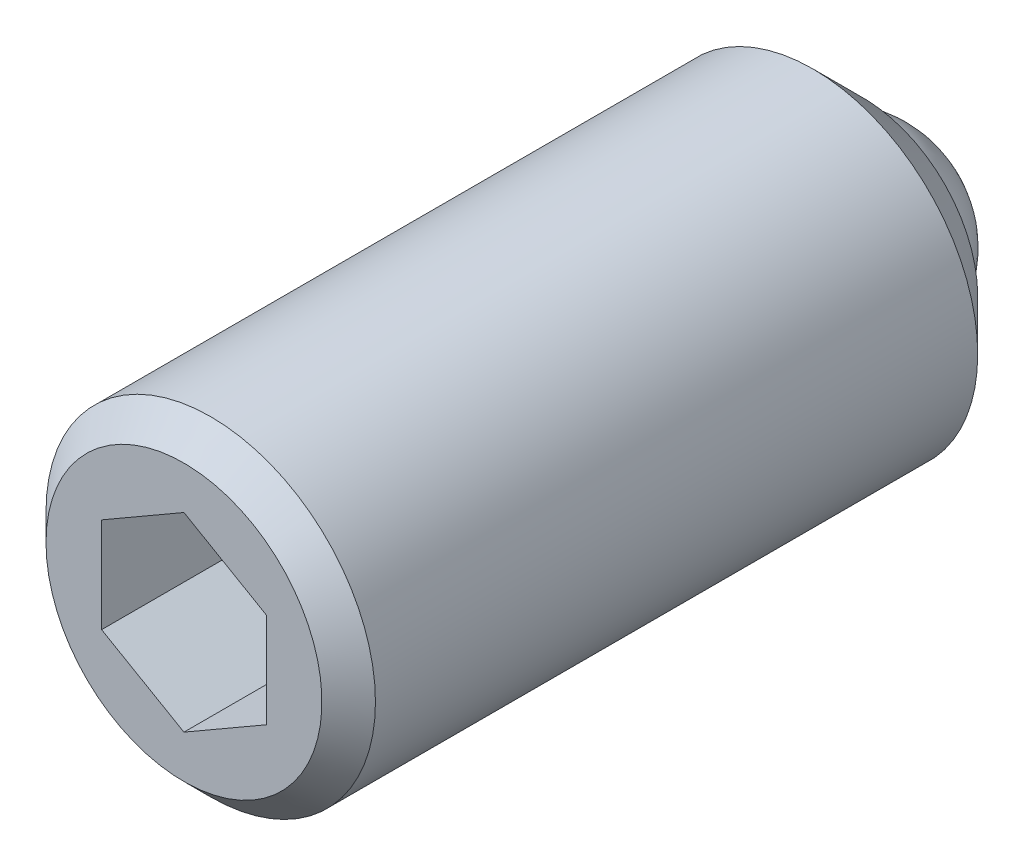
ISO-10303-21;
HEADER;
FILE_DESCRIPTION(('STEP AP214'),'2;1');
FILE_NAME('part.step','',(''),(''),'','','');
FILE_SCHEMA(('AUTOMOTIVE_DESIGN { 1 0 10303 214 1 1 1 1 }'));
ENDSEC;
DATA;
#1=APPLICATION_CONTEXT('core data for automotive mechanical design processes');
#2=APPLICATION_PROTOCOL_DEFINITION('international standard','automotive_design',2000,#1);
#3=PRODUCT_CONTEXT('',#1,'mechanical');
#4=PRODUCT('Part','Part','',(#3));
#5=PRODUCT_RELATED_PRODUCT_CATEGORY('part','',(#4));
#6=PRODUCT_DEFINITION_FORMATION('','',#4);
#7=PRODUCT_DEFINITION_CONTEXT('part definition',#1,'design');
#8=PRODUCT_DEFINITION('design','',#6,#7);
#9=PRODUCT_DEFINITION_SHAPE('','',#8);
#10=(LENGTH_UNIT() NAMED_UNIT(*) SI_UNIT(.MILLI.,.METRE.));
#11=(NAMED_UNIT(*) PLANE_ANGLE_UNIT() SI_UNIT($,.RADIAN.));
#12=(NAMED_UNIT(*) SI_UNIT($,.STERADIAN.) SOLID_ANGLE_UNIT());
#13=UNCERTAINTY_MEASURE_WITH_UNIT(LENGTH_MEASURE(1.E-05),#10,'distance_accuracy_value','');
#14=(GEOMETRIC_REPRESENTATION_CONTEXT(3) GLOBAL_UNCERTAINTY_ASSIGNED_CONTEXT((#13)) GLOBAL_UNIT_ASSIGNED_CONTEXT((#10,
#11,#12)) REPRESENTATION_CONTEXT('',''));
#15=CARTESIAN_POINT('',(0.,0.,0.));
#16=DIRECTION('',(0.,0.,1.));
#17=DIRECTION('',(1.,0.,0.));
#18=AXIS2_PLACEMENT_3D('',#15,#16,#17);
#19=CARTESIAN_POINT('',(-2.48600702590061E-08,-1.66276856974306E-13,-19.1274169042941));
#20=DIRECTION('',(4.46903193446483E-10,0.,1.));
#21=DIRECTION('',(1.,0.,-4.46903193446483E-10));
#22=AXIS2_PLACEMENT_3D('',#19,#20,#21);
#23=CYLINDRICAL_SURFACE('',#22,7.99999996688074);
#24=CARTESIAN_POINT('',(-5.80974152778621E-10,0.,35.2));
#25=DIRECTION('',(-4.46903193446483E-10,0.,-1.));
#26=DIRECTION('',(-1.,0.,4.46903193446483E-10));
#27=AXIS2_PLACEMENT_3D('',#24,#25,#26);
#28=CIRCLE('',#27,7.99999996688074);
#29=CARTESIAN_POINT('',(-7.99999996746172,0.,35.2000000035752));
#30=VERTEX_POINT('',#29);
#31=EDGE_CURVE('E9',#30,#30,#28,.T.);
#32=ORIENTED_EDGE('',*,*,#31,.T.);
#33=EDGE_LOOP('',(#32));
#34=FACE_BOUND('',#33,.T.);
#35=CARTESIAN_POINT('',(-1.36528925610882E-08,0.,5.95));
#36=DIRECTION('',(4.46903193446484E-10,0.,1.));
#37=DIRECTION('',(1.,0.,-4.46903193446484E-10));
#38=AXIS2_PLACEMENT_3D('',#35,#36,#37);
#39=CIRCLE('',#38,7.99999996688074);
#40=CARTESIAN_POINT('',(7.99999995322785,0.,5.94999999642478));
#41=VERTEX_POINT('',#40);
#42=EDGE_CURVE('E124',#41,#41,#39,.T.);
#43=ORIENTED_EDGE('',*,*,#42,.T.);
#44=EDGE_LOOP('',(#43));
#45=FACE_BOUND('',#44,.T.);
#46=ADVANCED_FACE('F14',(#34,#45),#23,.T.);
#47=CARTESIAN_POINT('',(2.04799996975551,5.80121547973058,30.4999999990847));
#48=DIRECTION('',(-4.46903193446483E-10,0.,-1.));
#49=DIRECTION('',(0.500000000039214,-0.866025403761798,-2.23449008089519E-10));
#50=AXIS2_PLACEMENT_3D('',#47,#48,#49);
#51=PLANE('',#50);
#52=DIRECTION('',(0.866025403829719,-0.499999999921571,-3.87028024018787E-10));
#53=VECTOR('',#52,1.);
#54=CARTESIAN_POINT('',(-2.00000002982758,-3.46410164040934,30.5000000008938));
#55=LINE('',#54,#53);
#56=CARTESIAN_POINT('',(-4.00000002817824,-2.30940110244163,30.5000000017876));
#57=VERTEX_POINT('',#56);
#58=CARTESIAN_POINT('',(-2.8993305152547E-08,-4.61880217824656,30.5));
#59=VERTEX_POINT('',#58);
#60=EDGE_CURVE('E78',#57,#59,#55,.T.);
#61=ORIENTED_EDGE('',*,*,#60,.T.);
#62=DIRECTION('',(0.866025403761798,0.500000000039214,-3.87031013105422E-10));
#63=VECTOR('',#62,1.);
#64=CARTESIAN_POINT('',(1.99999997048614,-3.4641016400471,30.4999999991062));
#65=LINE('',#64,#63);
#66=CARTESIAN_POINT('',(3.99999997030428,-2.3094011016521,30.4999999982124));
#67=VERTEX_POINT('',#66);
#68=EDGE_CURVE('E72',#59,#67,#65,.T.);
#69=ORIENTED_EDGE('',*,*,#68,.T.);
#70=DIRECTION('',(0.,1.,0.));
#71=VECTOR('',#70,1.);
#72=CARTESIAN_POINT('',(3.99999997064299,-2.46376610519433E-08,30.4999999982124));
#73=LINE('',#72,#71);
#74=CARTESIAN_POINT('',(3.9999999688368,2.30940105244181,30.4999999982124));
#75=VERTEX_POINT('',#74);
#76=EDGE_CURVE('E75',#67,#75,#73,.T.);
#77=ORIENTED_EDGE('',*,*,#76,.T.);
#78=DIRECTION('',(-0.866025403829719,0.499999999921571,3.87028024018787E-10));
#79=VECTOR('',#78,1.);
#80=CARTESIAN_POINT('',(1.99999997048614,3.46410159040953,30.4999999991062));
#81=LINE('',#80,#79);
#82=CARTESIAN_POINT('',(-3.00094354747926E-08,4.61880212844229,30.5));
#83=VERTEX_POINT('',#82);
#84=EDGE_CURVE('E91',#75,#83,#81,.T.);
#85=ORIENTED_EDGE('',*,*,#84,.T.);
#86=DIRECTION('',(-0.866025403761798,-0.500000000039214,3.87031013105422E-10));
#87=VECTOR('',#86,1.);
#88=CARTESIAN_POINT('',(-2.00000002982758,3.46410159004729,30.5000000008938));
#89=LINE('',#88,#87);
#90=CARTESIAN_POINT('',(-4.00000002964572,2.30940105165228,30.5000000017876));
#91=VERTEX_POINT('',#90);
#92=EDGE_CURVE('E96',#83,#91,#89,.T.);
#93=ORIENTED_EDGE('',*,*,#92,.T.);
#94=DIRECTION('',(0.,-1.,0.));
#95=VECTOR('',#94,1.);
#96=CARTESIAN_POINT('',(-4.00000002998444,-2.53621529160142E-08,30.5000000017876));
#97=LINE('',#96,#95);
#98=EDGE_CURVE('E99',#91,#57,#97,.T.);
#99=ORIENTED_EDGE('',*,*,#98,.T.);
#100=EDGE_LOOP('',(#61,#69,#77,#85,#93,#99));
#101=FACE_BOUND('',#100,.T.);
#102=ADVANCED_FACE('F73',(#101),#51,.F.);
#103=CARTESIAN_POINT('',(-2.69893048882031E-08,-4.61880217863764,36.5));
#104=DIRECTION('',(-0.499999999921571,-0.866025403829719,2.2345418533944E-10));
#105=DIRECTION('',(-0.866025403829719,0.499999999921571,3.87028024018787E-10));
#106=AXIS2_PLACEMENT_3D('',#103,#104,#105);
#107=PLANE('',#106);
#108=DIRECTION('',(4.46903193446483E-10,0.,1.));
#109=VECTOR('',#108,1.);
#110=CARTESIAN_POINT('',(-2.83300119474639E-08,-4.61880217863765,33.5));
#111=LINE('',#110,#109);
#112=CARTESIAN_POINT('',(-2.8993305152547E-08,-4.61880217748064,36.5));
#113=VERTEX_POINT('',#112);
#114=EDGE_CURVE('E52',#59,#113,#111,.T.);
#115=ORIENTED_EDGE('',*,*,#114,.F.);
#116=ORIENTED_EDGE('',*,*,#60,.F.);
#117=DIRECTION('',(-4.46903193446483E-10,0.,-1.));
#118=VECTOR('',#117,1.);
#119=CARTESIAN_POINT('',(-4.00000002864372,-2.30940110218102,33.5000000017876));
#120=LINE('',#119,#118);
#121=CARTESIAN_POINT('',(-4.00000002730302,-2.30940110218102,36.5000000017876));
#122=VERTEX_POINT('',#121);
#123=EDGE_CURVE('E101',#122,#57,#120,.T.);
#124=ORIENTED_EDGE('',*,*,#123,.F.);
#125=DIRECTION('',(-0.866025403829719,0.499999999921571,3.87028024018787E-10));
#126=VECTOR('',#125,1.);
#127=CARTESIAN_POINT('',(-2.69893048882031E-08,-4.61880217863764,36.5));
#128=LINE('',#127,#126);
#129=EDGE_CURVE('E114',#122,#113,#128,.F.);
#130=ORIENTED_EDGE('',*,*,#129,.T.);
#131=EDGE_LOOP('',(#115,#116,#124,#130));
#132=FACE_BOUND('',#131,.T.);
#133=ADVANCED_FACE('F148',(#132),#107,.F.);
#134=CARTESIAN_POINT('',(3.99999997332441,-2.30940110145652,36.4999999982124));
#135=DIRECTION('',(0.500000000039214,-0.866025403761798,-2.23449008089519E-10));
#136=DIRECTION('',(-0.866025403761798,-0.500000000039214,3.87031013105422E-10));
#137=AXIS2_PLACEMENT_3D('',#134,#135,#136);
#138=PLANE('',#137);
#139=DIRECTION('',(-4.46903193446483E-10,0.,-1.));
#140=VECTOR('',#139,1.);
#141=CARTESIAN_POINT('',(3.9999999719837,-2.30940110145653,33.4999999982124));
#142=LINE('',#141,#140);
#143=CARTESIAN_POINT('',(3.99999997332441,-2.30940109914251,36.4999999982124));
#144=VERTEX_POINT('',#143);
#145=EDGE_CURVE('E79',#144,#67,#142,.T.);
#146=ORIENTED_EDGE('',*,*,#145,.T.);
#147=ORIENTED_EDGE('',*,*,#68,.F.);
#148=ORIENTED_EDGE('',*,*,#114,.T.);
#149=DIRECTION('',(0.866025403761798,0.500000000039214,-3.87031013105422E-10));
#150=VECTOR('',#149,1.);
#151=CARTESIAN_POINT('',(1.99999997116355,-3.46410163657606,36.4999999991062));
#152=LINE('',#151,#150);
#153=EDGE_CURVE('E46',#113,#144,#152,.T.);
#154=ORIENTED_EDGE('',*,*,#153,.T.);
#155=EDGE_LOOP('',(#146,#147,#148,#154));
#156=FACE_BOUND('',#155,.T.);
#157=ADVANCED_FACE('F82',(#156),#138,.F.);
#158=CARTESIAN_POINT('',(3.99999997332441,2.30940105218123,36.4999999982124));
#159=DIRECTION('',(1.,0.,-4.46903193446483E-10));
#160=DIRECTION('',(0.,-1.,0.));
#161=AXIS2_PLACEMENT_3D('',#158,#159,#160);
#162=PLANE('',#161);
#163=DIRECTION('',(-4.46903193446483E-10,0.,-1.));
#164=VECTOR('',#163,1.);
#165=CARTESIAN_POINT('',(3.9999999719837,2.30940105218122,33.4999999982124));
#166=LINE('',#165,#164);
#167=CARTESIAN_POINT('',(3.99999997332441,2.30940105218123,36.4999999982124));
#168=VERTEX_POINT('',#167);
#169=EDGE_CURVE('E88',#168,#75,#166,.T.);
#170=ORIENTED_EDGE('',*,*,#169,.T.);
#171=ORIENTED_EDGE('',*,*,#76,.F.);
#172=ORIENTED_EDGE('',*,*,#145,.F.);
#173=DIRECTION('',(0.,-1.,0.));
#174=VECTOR('',#173,1.);
#175=CARTESIAN_POINT('',(3.99999997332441,2.30940105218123,36.4999999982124));
#176=LINE('',#175,#174);
#177=EDGE_CURVE('E111',#144,#168,#176,.F.);
#178=ORIENTED_EDGE('',*,*,#177,.T.);
#179=EDGE_LOOP('',(#170,#171,#172,#178));
#180=FACE_BOUND('',#179,.T.);
#181=ADVANCED_FACE('F86',(#180),#162,.F.);
#182=CARTESIAN_POINT('',(-2.69893061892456E-08,4.61880212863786,36.5));
#183=DIRECTION('',(0.499999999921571,0.866025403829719,-2.2345418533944E-10));
#184=DIRECTION('',(0.866025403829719,-0.499999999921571,-3.87028024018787E-10));
#185=AXIS2_PLACEMENT_3D('',#182,#183,#184);
#186=PLANE('',#185);
#187=DIRECTION('',(-4.46903193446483E-10,0.,-1.));
#188=VECTOR('',#187,1.);
#189=CARTESIAN_POINT('',(-2.83300132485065E-08,4.61880212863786,33.5));
#190=LINE('',#189,#188);
#191=CARTESIAN_POINT('',(-2.49853063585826E-08,4.61880212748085,36.5));
#192=VERTEX_POINT('',#191);
#193=EDGE_CURVE('E95',#192,#83,#190,.T.);
#194=ORIENTED_EDGE('',*,*,#193,.T.);
#195=ORIENTED_EDGE('',*,*,#84,.F.);
#196=ORIENTED_EDGE('',*,*,#169,.F.);
#197=DIRECTION('',(0.866025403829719,-0.499999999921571,-3.87028024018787E-10));
#198=VECTOR('',#197,1.);
#199=CARTESIAN_POINT('',(-2.69893061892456E-08,4.61880212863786,36.5));
#200=LINE('',#199,#198);
#201=EDGE_CURVE('E105',#168,#192,#200,.F.);
#202=ORIENTED_EDGE('',*,*,#201,.T.);
#203=EDGE_LOOP('',(#194,#195,#196,#202));
#204=FACE_BOUND('',#203,.T.);
#205=ADVANCED_FACE('F160',(#204),#186,.F.);
#206=CARTESIAN_POINT('',(-4.00000002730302,2.30940105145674,36.5000000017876));
#207=DIRECTION('',(-0.500000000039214,0.866025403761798,2.23449008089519E-10));
#208=DIRECTION('',(0.866025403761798,0.500000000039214,-3.87031013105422E-10));
#209=AXIS2_PLACEMENT_3D('',#206,#207,#208);
#210=PLANE('',#209);
#211=DIRECTION('',(-4.46903193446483E-10,0.,-1.));
#212=VECTOR('',#211,1.);
#213=CARTESIAN_POINT('',(-4.00000002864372,2.30940105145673,33.5000000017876));
#214=LINE('',#213,#212);
#215=CARTESIAN_POINT('',(-4.00000002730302,2.30940104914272,36.5000000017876));
#216=VERTEX_POINT('',#215);
#217=EDGE_CURVE('E98',#216,#91,#214,.T.);
#218=ORIENTED_EDGE('',*,*,#217,.T.);
#219=ORIENTED_EDGE('',*,*,#92,.F.);
#220=ORIENTED_EDGE('',*,*,#193,.F.);
#221=DIRECTION('',(-0.866025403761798,-0.500000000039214,3.87031013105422E-10));
#222=VECTOR('',#221,1.);
#223=CARTESIAN_POINT('',(-2.00000002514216,3.46410158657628,36.5000000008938));
#224=LINE('',#223,#222);
#225=EDGE_CURVE('E103',#192,#216,#224,.T.);
#226=ORIENTED_EDGE('',*,*,#225,.T.);
#227=EDGE_LOOP('',(#218,#219,#220,#226));
#228=FACE_BOUND('',#227,.T.);
#229=ADVANCED_FACE('F163',(#228),#210,.F.);
#230=CARTESIAN_POINT('',(-4.00000002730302,-2.30940110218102,36.5000000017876));
#231=DIRECTION('',(-1.,0.,4.46903193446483E-10));
#232=DIRECTION('',(0.,1.,0.));
#233=AXIS2_PLACEMENT_3D('',#230,#231,#232);
#234=PLANE('',#233);
#235=ORIENTED_EDGE('',*,*,#123,.T.);
#236=ORIENTED_EDGE('',*,*,#98,.F.);
#237=ORIENTED_EDGE('',*,*,#217,.F.);
#238=DIRECTION('',(0.,1.,0.));
#239=VECTOR('',#238,1.);
#240=CARTESIAN_POINT('',(-4.00000002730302,-2.30940110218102,36.5000000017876));
#241=LINE('',#240,#239);
#242=EDGE_CURVE('E31',#216,#122,#241,.F.);
#243=ORIENTED_EDGE('',*,*,#242,.T.);
#244=EDGE_LOOP('',(#235,#236,#237,#243));
#245=FACE_BOUND('',#244,.T.);
#246=ADVANCED_FACE('F167',(#245),#234,.F.);
#247=CARTESIAN_POINT('',(2.42731730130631,8.99703242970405,36.4999999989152));
#248=DIRECTION('',(-4.46903193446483E-10,0.,-1.));
#249=DIRECTION('',(0.500000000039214,-0.866025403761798,-2.23449008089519E-10));
#250=AXIS2_PLACEMENT_3D('',#247,#248,#249);
#251=PLANE('',#250);
#252=CARTESIAN_POINT('',(0.,0.,36.5));
#253=DIRECTION('',(-4.46903193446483E-10,0.,-1.));
#254=DIRECTION('',(-1.,0.,4.46903193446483E-10));
#255=AXIS2_PLACEMENT_3D('',#252,#253,#254);
#256=CIRCLE('',#255,6.69999996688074);
#257=CARTESIAN_POINT('',(-6.69999996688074,0.,36.5000000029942));
#258=VERTEX_POINT('',#257);
#259=EDGE_CURVE('E23',#258,#258,#256,.F.);
#260=ORIENTED_EDGE('',*,*,#259,.T.);
#261=EDGE_LOOP('',(#260));
#262=FACE_BOUND('',#261,.T.);
#263=ORIENTED_EDGE('',*,*,#242,.F.);
#264=ORIENTED_EDGE('',*,*,#225,.F.);
#265=ORIENTED_EDGE('',*,*,#201,.F.);
#266=ORIENTED_EDGE('',*,*,#177,.F.);
#267=ORIENTED_EDGE('',*,*,#153,.F.);
#268=ORIENTED_EDGE('',*,*,#129,.F.);
#269=EDGE_LOOP('',(#263,#264,#265,#266,#267,#268));
#270=FACE_BOUND('',#269,.T.);
#271=ADVANCED_FACE('F129',(#262,#270),#251,.F.);
#272=CARTESIAN_POINT('',(0.,0.,5.));
#273=DIRECTION('',(0.,0.,-1.));
#274=DIRECTION('',(-1.,0.,0.));
#275=AXIS2_PLACEMENT_3D('',#272,#273,#274);
#276=SPHERICAL_SURFACE('',#275,5.);
#277=CARTESIAN_POINT('',(-6.70353615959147E-10,0.,3.5));
#278=DIRECTION('',(4.46903193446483E-10,0.,1.));
#279=DIRECTION('',(1.,0.,-4.46903193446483E-10));
#280=AXIS2_PLACEMENT_3D('',#277,#278,#279);
#281=CIRCLE('',#280,4.76969600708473);
#282=CARTESIAN_POINT('',(4.76969600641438,0.,3.49999999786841));
#283=VERTEX_POINT('',#282);
#284=EDGE_CURVE('E80',#283,#283,#281,.T.);
#285=ORIENTED_EDGE('',*,*,#284,.F.);
#286=EDGE_LOOP('',(#285));
#287=FACE_BOUND('',#286,.T.);
#288=ADVANCED_FACE('F152',(#287),#276,.T.);
#289=CARTESIAN_POINT('',(7.6891555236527,-2.0461550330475,3.49999999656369));
#290=DIRECTION('',(4.46903193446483E-10,0.,1.));
#291=DIRECTION('',(-0.500000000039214,0.866025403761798,2.23449008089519E-10));
#292=AXIS2_PLACEMENT_3D('',#289,#290,#291);
#293=PLANE('',#292);
#294=CARTESIAN_POINT('',(-1.47478053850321E-08,0.,3.5));
#295=DIRECTION('',(4.46903193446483E-10,0.,1.));
#296=DIRECTION('',(1.,0.,-4.46903193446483E-10));
#297=AXIS2_PLACEMENT_3D('',#294,#295,#296);
#298=CIRCLE('',#297,5.54999996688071);
#299=CARTESIAN_POINT('',(5.54999995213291,0.,3.49999999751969));
#300=VERTEX_POINT('',#299);
#301=EDGE_CURVE('E116',#300,#300,#298,.F.);
#302=ORIENTED_EDGE('',*,*,#301,.T.);
#303=EDGE_LOOP('',(#302));
#304=FACE_BOUND('',#303,.T.);
#305=ORIENTED_EDGE('',*,*,#284,.T.);
#306=EDGE_LOOP('',(#305));
#307=FACE_BOUND('',#306,.T.);
#308=ADVANCED_FACE('F139',(#304,#307),#293,.F.);
#309=CARTESIAN_POINT('',(-1.47478053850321E-08,0.,3.5));
#310=DIRECTION('',(4.46903193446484E-10,0.,1.));
#311=DIRECTION('',(1.,0.,-4.46903193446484E-10));
#312=AXIS2_PLACEMENT_3D('',#309,#310,#311);
#313=CONICAL_SURFACE('',#312,5.54999996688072,0.785398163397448);
#314=ORIENTED_EDGE('',*,*,#42,.F.);
#315=EDGE_LOOP('',(#314));
#316=FACE_BOUND('',#315,.T.);
#317=ORIENTED_EDGE('',*,*,#301,.F.);
#318=EDGE_LOOP('',(#317));
#319=FACE_BOUND('',#318,.T.);
#320=ADVANCED_FACE('F133',(#316,#319),#313,.T.);
#321=CARTESIAN_POINT('',(0.,0.,36.5));
#322=DIRECTION('',(-4.46903193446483E-10,0.,-1.));
#323=DIRECTION('',(-1.,0.,4.46903193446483E-10));
#324=AXIS2_PLACEMENT_3D('',#321,#322,#323);
#325=CONICAL_SURFACE('',#324,6.69999996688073,0.78539816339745);
#326=ORIENTED_EDGE('',*,*,#31,.F.);
#327=EDGE_LOOP('',(#326));
#328=FACE_BOUND('',#327,.T.);
#329=ORIENTED_EDGE('',*,*,#259,.F.);
#330=EDGE_LOOP('',(#329));
#331=FACE_BOUND('',#330,.T.);
#332=ADVANCED_FACE('F16',(#328,#331),#325,.T.);
#333=CLOSED_SHELL('',(#46,#102,#133,#157,#181,#205,#229,#246,#271,#288,#308,#320,#332));
#334=MANIFOLD_SOLID_BREP('B1',#333);
#335=ADVANCED_BREP_SHAPE_REPRESENTATION('',(#18,#334),#14);
#336=SHAPE_DEFINITION_REPRESENTATION(#9,#335);
ENDSEC;
END-ISO-10303-21;
